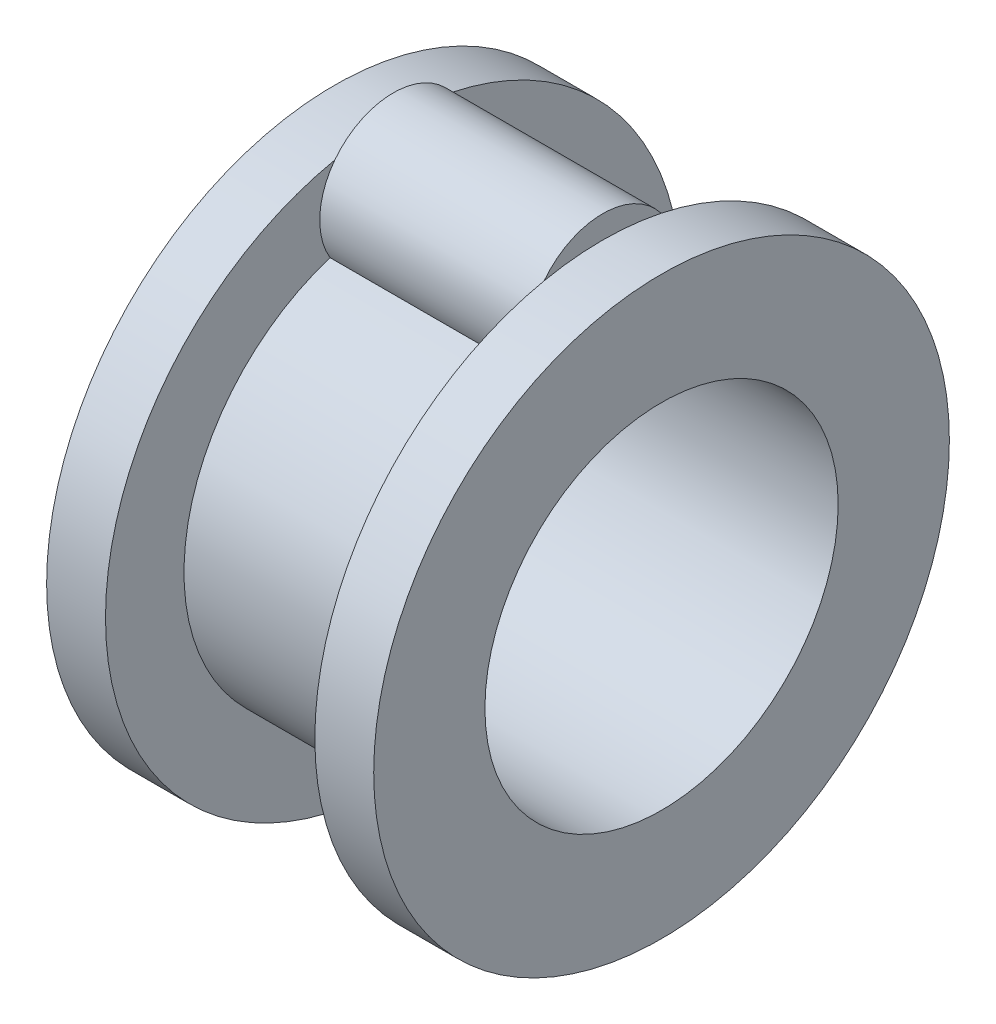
ISO-10303-21;
HEADER;
FILE_DESCRIPTION(('STEP AP214'),'2;1');
FILE_NAME('part.step','',(''),(''),'','','');
FILE_SCHEMA(('AUTOMOTIVE_DESIGN { 1 0 10303 214 1 1 1 1 }'));
ENDSEC;
DATA;
#1=APPLICATION_CONTEXT('core data for automotive mechanical design processes');
#2=APPLICATION_PROTOCOL_DEFINITION('international standard','automotive_design',2000,#1);
#3=PRODUCT_CONTEXT('',#1,'mechanical');
#4=PRODUCT('Part','Part','',(#3));
#5=PRODUCT_RELATED_PRODUCT_CATEGORY('part','',(#4));
#6=PRODUCT_DEFINITION_FORMATION('','',#4);
#7=PRODUCT_DEFINITION_CONTEXT('part definition',#1,'design');
#8=PRODUCT_DEFINITION('design','',#6,#7);
#9=PRODUCT_DEFINITION_SHAPE('','',#8);
#10=(LENGTH_UNIT() NAMED_UNIT(*) SI_UNIT(.MILLI.,.METRE.));
#11=(NAMED_UNIT(*) PLANE_ANGLE_UNIT() SI_UNIT($,.RADIAN.));
#12=(NAMED_UNIT(*) SI_UNIT($,.STERADIAN.) SOLID_ANGLE_UNIT());
#13=UNCERTAINTY_MEASURE_WITH_UNIT(LENGTH_MEASURE(1.E-05),#10,'distance_accuracy_value','');
#14=(GEOMETRIC_REPRESENTATION_CONTEXT(3) GLOBAL_UNCERTAINTY_ASSIGNED_CONTEXT((#13)) GLOBAL_UNIT_ASSIGNED_CONTEXT((#10,
#11,#12)) REPRESENTATION_CONTEXT('',''));
#15=CARTESIAN_POINT('',(0.,0.,0.));
#16=DIRECTION('',(0.,0.,1.));
#17=DIRECTION('',(1.,0.,0.));
#18=AXIS2_PLACEMENT_3D('',#15,#16,#17);
#19=CARTESIAN_POINT('',(-1.6,4.4,0.));
#20=DIRECTION('',(-1.,0.,0.));
#21=DIRECTION('',(0.,0.,1.));
#22=AXIS2_PLACEMENT_3D('',#19,#20,#21);
#23=PLANE('',#22);
#24=CARTESIAN_POINT('',(-1.6,3.625,0.));
#25=DIRECTION('',(1.,0.,0.));
#26=DIRECTION('',(0.,0.,-1.));
#27=AXIS2_PLACEMENT_3D('',#24,#25,#26);
#28=CIRCLE('',#27,1.125);
#29=CARTESIAN_POINT('',(-1.6,3.05034482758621,-0.967158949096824));
#30=VERTEX_POINT('',#29);
#31=CARTESIAN_POINT('',(-1.6,4.30827586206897,-0.893733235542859));
#32=VERTEX_POINT('',#31);
#33=EDGE_CURVE('E471',#30,#32,#28,.T.);
#34=ORIENTED_EDGE('',*,*,#33,.F.);
#35=CARTESIAN_POINT('',(-1.6,0.,0.));
#36=DIRECTION('',(-1.,0.,0.));
#37=DIRECTION('',(0.,0.,1.));
#38=AXIS2_PLACEMENT_3D('',#35,#36,#37);
#39=CIRCLE('',#38,3.2);
#40=CARTESIAN_POINT('',(-1.6,3.05034482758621,0.967158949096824));
#41=VERTEX_POINT('',#40);
#42=EDGE_CURVE('E450',#30,#41,#39,.T.);
#43=ORIENTED_EDGE('',*,*,#42,.T.);
#44=CARTESIAN_POINT('',(-1.6,4.30827586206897,0.893733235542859));
#45=VERTEX_POINT('',#44);
#46=EDGE_CURVE('E477',#45,#41,#28,.T.);
#47=ORIENTED_EDGE('',*,*,#46,.F.);
#48=CARTESIAN_POINT('',(-1.6,0.,0.));
#49=DIRECTION('',(-1.,0.,0.));
#50=DIRECTION('',(0.,0.,1.));
#51=AXIS2_PLACEMENT_3D('',#48,#49,#50);
#52=CIRCLE('',#51,4.4);
#53=EDGE_CURVE('E453',#32,#45,#52,.T.);
#54=ORIENTED_EDGE('',*,*,#53,.F.);
#55=EDGE_LOOP('',(#34,#43,#47,#54));
#56=FACE_BOUND('',#55,.T.);
#57=ADVANCED_FACE('F352',(#56),#23,.F.);
#58=CARTESIAN_POINT('',(-11.1727564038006,0.,0.));
#59=DIRECTION('',(-1.,0.,0.));
#60=DIRECTION('',(0.,0.,1.));
#61=AXIS2_PLACEMENT_3D('',#58,#59,#60);
#62=CYLINDRICAL_SURFACE('',#61,3.2);
#63=DIRECTION('',(-1.,0.,0.));
#64=VECTOR('',#63,1.);
#65=CARTESIAN_POINT('',(0.,3.05034482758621,-0.967158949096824));
#66=LINE('',#65,#64);
#67=CARTESIAN_POINT('',(1.6,3.05034482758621,-0.967158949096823));
#68=VERTEX_POINT('',#67);
#69=EDGE_CURVE('E436',#68,#30,#66,.T.);
#70=ORIENTED_EDGE('',*,*,#69,.F.);
#71=CARTESIAN_POINT('',(1.6,0.,0.));
#72=DIRECTION('',(-1.,0.,0.));
#73=DIRECTION('',(0.,0.,1.));
#74=AXIS2_PLACEMENT_3D('',#71,#72,#73);
#75=CIRCLE('',#74,3.2);
#76=CARTESIAN_POINT('',(1.6,3.05034482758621,0.967158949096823));
#77=VERTEX_POINT('',#76);
#78=EDGE_CURVE('E417',#68,#77,#75,.T.);
#79=ORIENTED_EDGE('',*,*,#78,.T.);
#80=DIRECTION('',(-1.,0.,0.));
#81=VECTOR('',#80,1.);
#82=CARTESIAN_POINT('',(0.,3.05034482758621,0.967158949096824));
#83=LINE('',#82,#81);
#84=EDGE_CURVE('E431',#41,#77,#83,.F.);
#85=ORIENTED_EDGE('',*,*,#84,.F.);
#86=ORIENTED_EDGE('',*,*,#42,.F.);
#87=EDGE_LOOP('',(#70,#79,#85,#86));
#88=FACE_BOUND('',#87,.T.);
#89=ADVANCED_FACE('F497',(#88),#62,.T.);
#90=CARTESIAN_POINT('',(1.6,3.2,0.));
#91=DIRECTION('',(1.,0.,0.));
#92=DIRECTION('',(0.,0.,-1.));
#93=AXIS2_PLACEMENT_3D('',#90,#91,#92);
#94=PLANE('',#93);
#95=CARTESIAN_POINT('',(1.6,3.625,0.));
#96=DIRECTION('',(1.,0.,0.));
#97=DIRECTION('',(0.,0.,-1.));
#98=AXIS2_PLACEMENT_3D('',#95,#96,#97);
#99=CIRCLE('',#98,1.125);
#100=CARTESIAN_POINT('',(1.6,4.30827586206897,0.893733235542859));
#101=VERTEX_POINT('',#100);
#102=EDGE_CURVE('E430',#101,#77,#99,.T.);
#103=ORIENTED_EDGE('',*,*,#102,.T.);
#104=ORIENTED_EDGE('',*,*,#78,.F.);
#105=CARTESIAN_POINT('',(1.6,4.30827586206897,-0.893733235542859));
#106=VERTEX_POINT('',#105);
#107=EDGE_CURVE('E414',#68,#106,#99,.T.);
#108=ORIENTED_EDGE('',*,*,#107,.T.);
#109=CARTESIAN_POINT('',(1.6,0.,0.));
#110=DIRECTION('',(-1.,0.,0.));
#111=DIRECTION('',(0.,0.,1.));
#112=AXIS2_PLACEMENT_3D('',#109,#110,#111);
#113=CIRCLE('',#112,4.4);
#114=EDGE_CURVE('E402',#106,#101,#113,.T.);
#115=ORIENTED_EDGE('',*,*,#114,.T.);
#116=EDGE_LOOP('',(#103,#104,#108,#115));
#117=FACE_BOUND('',#116,.T.);
#118=ADVANCED_FACE('F415',(#117),#94,.F.);
#119=CARTESIAN_POINT('',(-11.1727564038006,0.,0.));
#120=DIRECTION('',(-1.,0.,0.));
#121=DIRECTION('',(0.,0.,1.));
#122=AXIS2_PLACEMENT_3D('',#119,#120,#121);
#123=CYLINDRICAL_SURFACE('',#122,2.7);
#124=DIRECTION('',(-1.,0.,0.));
#125=VECTOR('',#124,1.);
#126=CARTESIAN_POINT('',(0.,2.64344827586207,0.54971011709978));
#127=LINE('',#126,#125);
#128=CARTESIAN_POINT('',(1.6,2.64344827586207,0.54971011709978));
#129=VERTEX_POINT('',#128);
#130=CARTESIAN_POINT('',(-1.6,2.64344827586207,0.54971011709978));
#131=VERTEX_POINT('',#130);
#132=EDGE_CURVE('E372',#129,#131,#127,.T.);
#133=ORIENTED_EDGE('',*,*,#132,.F.);
#134=CARTESIAN_POINT('',(1.6,0.,0.));
#135=DIRECTION('',(1.,0.,0.));
#136=DIRECTION('',(0.,0.,-1.));
#137=AXIS2_PLACEMENT_3D('',#134,#135,#136);
#138=CIRCLE('',#137,2.7);
#139=CARTESIAN_POINT('',(1.6,2.64344827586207,-0.54971011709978));
#140=VERTEX_POINT('',#139);
#141=EDGE_CURVE('E367',#129,#140,#138,.F.);
#142=ORIENTED_EDGE('',*,*,#141,.T.);
#143=DIRECTION('',(-1.,0.,0.));
#144=VECTOR('',#143,1.);
#145=CARTESIAN_POINT('',(0.,2.64344827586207,-0.54971011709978));
#146=LINE('',#145,#144);
#147=CARTESIAN_POINT('',(-1.6,2.64344827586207,-0.54971011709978));
#148=VERTEX_POINT('',#147);
#149=EDGE_CURVE('E439',#148,#140,#146,.F.);
#150=ORIENTED_EDGE('',*,*,#149,.F.);
#151=CARTESIAN_POINT('',(-1.6,0.,0.));
#152=DIRECTION('',(1.,0.,0.));
#153=DIRECTION('',(0.,0.,-1.));
#154=AXIS2_PLACEMENT_3D('',#151,#152,#153);
#155=CIRCLE('',#154,2.7);
#156=EDGE_CURVE('E441',#131,#148,#155,.F.);
#157=ORIENTED_EDGE('',*,*,#156,.F.);
#158=EDGE_LOOP('',(#133,#142,#150,#157));
#159=FACE_BOUND('',#158,.T.);
#160=CARTESIAN_POINT('',(2.5,0.,0.));
#161=DIRECTION('',(-1.,0.,0.));
#162=DIRECTION('',(0.,0.,1.));
#163=AXIS2_PLACEMENT_3D('',#160,#161,#162);
#164=CIRCLE('',#163,2.7);
#165=CARTESIAN_POINT('',(2.5,0.,2.7));
#166=VERTEX_POINT('',#165);
#167=EDGE_CURVE('E444',#166,#166,#164,.T.);
#168=ORIENTED_EDGE('',*,*,#167,.F.);
#169=EDGE_LOOP('',(#168));
#170=FACE_BOUND('',#169,.T.);
#171=CARTESIAN_POINT('',(-2.5,0.,0.));
#172=DIRECTION('',(-1.,0.,0.));
#173=DIRECTION('',(0.,0.,1.));
#174=AXIS2_PLACEMENT_3D('',#171,#172,#173);
#175=CIRCLE('',#174,2.7);
#176=CARTESIAN_POINT('',(-2.5,0.,2.7));
#177=VERTEX_POINT('',#176);
#178=EDGE_CURVE('E11',#177,#177,#175,.T.);
#179=ORIENTED_EDGE('',*,*,#178,.T.);
#180=EDGE_LOOP('',(#179));
#181=FACE_BOUND('',#180,.T.);
#182=ADVANCED_FACE('F354',(#159,#170,#181),#123,.F.);
#183=CARTESIAN_POINT('',(-2.5,2.7,0.));
#184=DIRECTION('',(1.,0.,0.));
#185=DIRECTION('',(0.,0.,-1.));
#186=AXIS2_PLACEMENT_3D('',#183,#184,#185);
#187=PLANE('',#186);
#188=ORIENTED_EDGE('',*,*,#178,.F.);
#189=EDGE_LOOP('',(#188));
#190=FACE_BOUND('',#189,.T.);
#191=CARTESIAN_POINT('',(-2.5,0.,0.));
#192=DIRECTION('',(-1.,0.,0.));
#193=DIRECTION('',(0.,0.,1.));
#194=AXIS2_PLACEMENT_3D('',#191,#192,#193);
#195=CIRCLE('',#194,4.4);
#196=CARTESIAN_POINT('',(-2.5,0.,4.4));
#197=VERTEX_POINT('',#196);
#198=EDGE_CURVE('E360',#197,#197,#195,.T.);
#199=ORIENTED_EDGE('',*,*,#198,.T.);
#200=EDGE_LOOP('',(#199));
#201=FACE_BOUND('',#200,.T.);
#202=ADVANCED_FACE('F459',(#190,#201),#187,.F.);
#203=CARTESIAN_POINT('',(-11.1727564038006,0.,0.));
#204=DIRECTION('',(-1.,0.,0.));
#205=DIRECTION('',(0.,0.,1.));
#206=AXIS2_PLACEMENT_3D('',#203,#204,#205);
#207=CYLINDRICAL_SURFACE('',#206,4.4);
#208=ORIENTED_EDGE('',*,*,#198,.F.);
#209=EDGE_LOOP('',(#208));
#210=FACE_BOUND('',#209,.T.);
#211=EDGE_CURVE('E454',#45,#32,#52,.T.);
#212=ORIENTED_EDGE('',*,*,#211,.T.);
#213=ORIENTED_EDGE('',*,*,#53,.T.);
#214=EDGE_LOOP('',(#212,#213));
#215=FACE_BOUND('',#214,.T.);
#216=ADVANCED_FACE('F461',(#210,#215),#207,.T.);
#217=CARTESIAN_POINT('',(-11.1727564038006,0.,0.));
#218=DIRECTION('',(-1.,0.,0.));
#219=DIRECTION('',(0.,0.,1.));
#220=AXIS2_PLACEMENT_3D('',#217,#218,#219);
#221=CYLINDRICAL_SURFACE('',#220,4.4);
#222=EDGE_CURVE('E407',#101,#106,#113,.T.);
#223=ORIENTED_EDGE('',*,*,#222,.F.);
#224=ORIENTED_EDGE('',*,*,#114,.F.);
#225=EDGE_LOOP('',(#223,#224));
#226=FACE_BOUND('',#225,.T.);
#227=CARTESIAN_POINT('',(2.5,0.,0.));
#228=DIRECTION('',(-1.,0.,0.));
#229=DIRECTION('',(0.,0.,1.));
#230=AXIS2_PLACEMENT_3D('',#227,#228,#229);
#231=CIRCLE('',#230,4.4);
#232=CARTESIAN_POINT('',(2.5,0.,4.4));
#233=VERTEX_POINT('',#232);
#234=EDGE_CURVE('E410',#233,#233,#231,.T.);
#235=ORIENTED_EDGE('',*,*,#234,.T.);
#236=EDGE_LOOP('',(#235));
#237=FACE_BOUND('',#236,.T.);
#238=ADVANCED_FACE('F404',(#226,#237),#221,.T.);
#239=CARTESIAN_POINT('',(2.5,4.4,0.));
#240=DIRECTION('',(-1.,0.,0.));
#241=DIRECTION('',(0.,0.,1.));
#242=AXIS2_PLACEMENT_3D('',#239,#240,#241);
#243=PLANE('',#242);
#244=ORIENTED_EDGE('',*,*,#234,.F.);
#245=EDGE_LOOP('',(#244));
#246=FACE_BOUND('',#245,.T.);
#247=ORIENTED_EDGE('',*,*,#167,.T.);
#248=EDGE_LOOP('',(#247));
#249=FACE_BOUND('',#248,.T.);
#250=ADVANCED_FACE('F509',(#246,#249),#243,.F.);
#251=CARTESIAN_POINT('',(1.6,3.625,0.));
#252=DIRECTION('',(1.,0.,0.));
#253=DIRECTION('',(0.,0.,-1.));
#254=AXIS2_PLACEMENT_3D('',#251,#252,#253);
#255=PLANE('',#254);
#256=ORIENTED_EDGE('',*,*,#222,.T.);
#257=EDGE_CURVE('E424',#106,#101,#99,.T.);
#258=ORIENTED_EDGE('',*,*,#257,.T.);
#259=EDGE_LOOP('',(#256,#258));
#260=FACE_BOUND('',#259,.T.);
#261=ADVANCED_FACE('F427',(#260),#255,.T.);
#262=CARTESIAN_POINT('',(1.6,3.625,0.));
#263=DIRECTION('',(-1.,0.,0.));
#264=DIRECTION('',(0.,0.,1.));
#265=AXIS2_PLACEMENT_3D('',#262,#263,#264);
#266=CYLINDRICAL_SURFACE('',#265,1.125);
#267=ORIENTED_EDGE('',*,*,#107,.F.);
#268=ORIENTED_EDGE('',*,*,#69,.T.);
#269=ORIENTED_EDGE('',*,*,#33,.T.);
#270=EDGE_CURVE('E422',#32,#45,#28,.T.);
#271=ORIENTED_EDGE('',*,*,#270,.T.);
#272=ORIENTED_EDGE('',*,*,#46,.T.);
#273=ORIENTED_EDGE('',*,*,#84,.T.);
#274=ORIENTED_EDGE('',*,*,#102,.F.);
#275=ORIENTED_EDGE('',*,*,#257,.F.);
#276=EDGE_LOOP('',(#267,#268,#269,#271,#272,#273,#274,#275));
#277=FACE_BOUND('',#276,.T.);
#278=ADVANCED_FACE('F428',(#277),#266,.T.);
#279=CARTESIAN_POINT('',(-1.6,3.625,0.));
#280=DIRECTION('',(1.,0.,0.));
#281=DIRECTION('',(0.,0.,-1.));
#282=AXIS2_PLACEMENT_3D('',#279,#280,#281);
#283=PLANE('',#282);
#284=ORIENTED_EDGE('',*,*,#270,.F.);
#285=ORIENTED_EDGE('',*,*,#211,.F.);
#286=EDGE_LOOP('',(#284,#285));
#287=FACE_BOUND('',#286,.T.);
#288=ADVANCED_FACE('F476',(#287),#283,.F.);
#289=EDGE_CURVE('E475',#131,#148,#28,.T.);
#290=ORIENTED_EDGE('',*,*,#289,.F.);
#291=ORIENTED_EDGE('',*,*,#156,.T.);
#292=EDGE_LOOP('',(#290,#291));
#293=FACE_BOUND('',#292,.T.);
#294=ADVANCED_FACE('F485',(#293),#283,.F.);
#295=ORIENTED_EDGE('',*,*,#289,.T.);
#296=ORIENTED_EDGE('',*,*,#149,.T.);
#297=EDGE_CURVE('E421',#129,#140,#99,.T.);
#298=ORIENTED_EDGE('',*,*,#297,.F.);
#299=ORIENTED_EDGE('',*,*,#132,.T.);
#300=EDGE_LOOP('',(#295,#296,#298,#299));
#301=FACE_BOUND('',#300,.T.);
#302=ADVANCED_FACE('F481',(#301),#266,.T.);
#303=ORIENTED_EDGE('',*,*,#141,.F.);
#304=ORIENTED_EDGE('',*,*,#297,.T.);
#305=EDGE_LOOP('',(#303,#304));
#306=FACE_BOUND('',#305,.T.);
#307=ADVANCED_FACE('F514',(#306),#255,.T.);
#308=CLOSED_SHELL('',(#57,#89,#118,#182,#202,#216,#238,#250,#261,#278,#288,#294,#302,#307));
#309=MANIFOLD_SOLID_BREP('B2',#308);
#310=ADVANCED_BREP_SHAPE_REPRESENTATION('',(#18,#309),#14);
#311=SHAPE_DEFINITION_REPRESENTATION(#9,#310);
ENDSEC;
END-ISO-10303-21;
